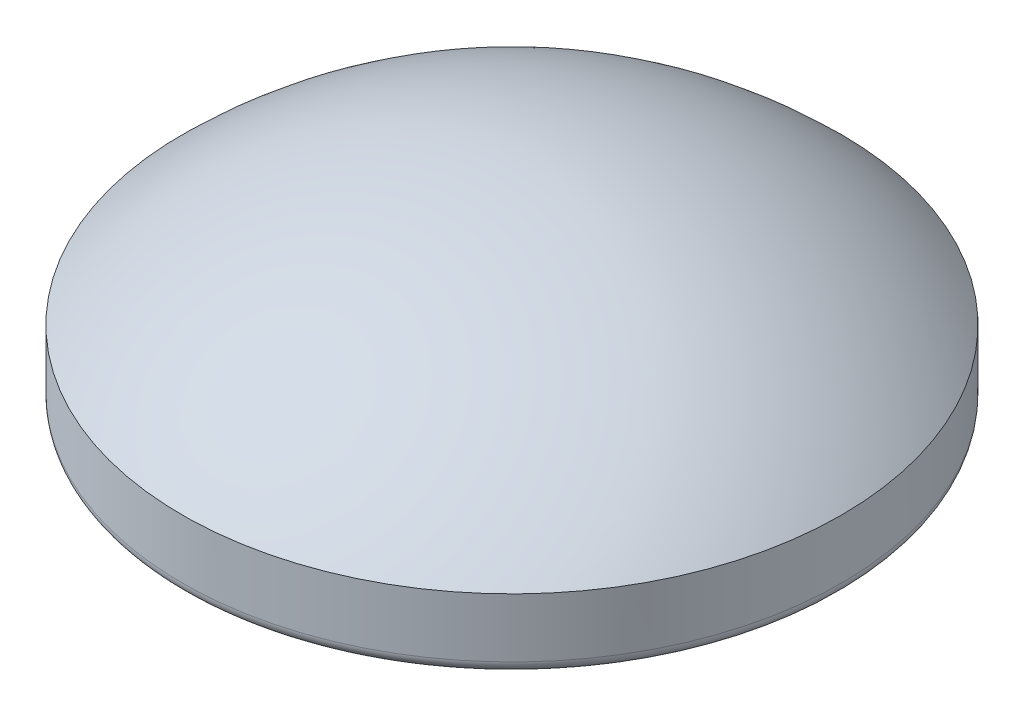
from build123d import *


with BuildPart() as part:
    # Esquisse1 → R_volution1 (revolve)
    with BuildSketch(Plane.XY, mode=Mode.PRIVATE) as r_volution1_sk:
        with BuildLine():
            Line((25.1, 0), (25.1, 5))
            ThreePointArc((25.1, 5), (13.509348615, 12.407965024), (0, 15))
            Line((0, 15), (0, 17))
            ThreePointArc((0, 17), (14.652665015, 14.102700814), (27.1, 5.846867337))
            Line((27.1, 5.846867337), (27.1, 1))
            ThreePointArc((27.1, 1), (26.807106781, 0.292893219), (26.1, 0))
            Line((26.1, 0), (25.1, 0))
        make_face()
    revolve(r_volution1_sk.sketch.rotate(Axis((0, 0, 0), (0, 1, 0)), 90), axis=Axis((0, 0, 0), (0, 1, 0)))


solid = part.part
